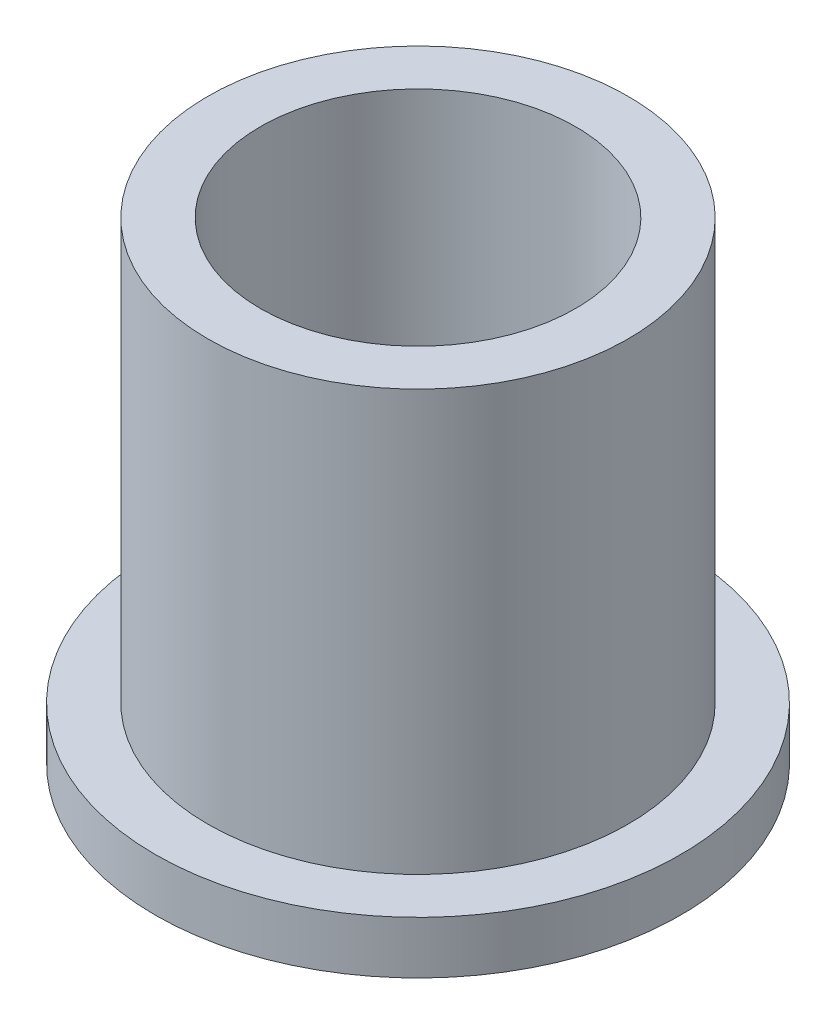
ISO-10303-21;
HEADER;
FILE_DESCRIPTION(('STEP AP214'),'2;1');
FILE_NAME('part.step','',(''),(''),'','','');
FILE_SCHEMA(('AUTOMOTIVE_DESIGN { 1 0 10303 214 1 1 1 1 }'));
ENDSEC;
DATA;
#1=APPLICATION_CONTEXT('core data for automotive mechanical design processes');
#2=APPLICATION_PROTOCOL_DEFINITION('international standard','automotive_design',2000,#1);
#3=PRODUCT_CONTEXT('',#1,'mechanical');
#4=PRODUCT('Part','Part','',(#3));
#5=PRODUCT_RELATED_PRODUCT_CATEGORY('part','',(#4));
#6=PRODUCT_DEFINITION_FORMATION('','',#4);
#7=PRODUCT_DEFINITION_CONTEXT('part definition',#1,'design');
#8=PRODUCT_DEFINITION('design','',#6,#7);
#9=PRODUCT_DEFINITION_SHAPE('','',#8);
#10=(LENGTH_UNIT() NAMED_UNIT(*) SI_UNIT(.MILLI.,.METRE.));
#11=(NAMED_UNIT(*) PLANE_ANGLE_UNIT() SI_UNIT($,.RADIAN.));
#12=(NAMED_UNIT(*) SI_UNIT($,.STERADIAN.) SOLID_ANGLE_UNIT());
#13=UNCERTAINTY_MEASURE_WITH_UNIT(LENGTH_MEASURE(1.E-05),#10,'distance_accuracy_value','');
#14=(GEOMETRIC_REPRESENTATION_CONTEXT(3) GLOBAL_UNCERTAINTY_ASSIGNED_CONTEXT((#13)) GLOBAL_UNIT_ASSIGNED_CONTEXT((#10,
#11,#12)) REPRESENTATION_CONTEXT('',''));
#15=CARTESIAN_POINT('',(0.,0.,0.));
#16=DIRECTION('',(0.,0.,1.));
#17=DIRECTION('',(1.,0.,0.));
#18=AXIS2_PLACEMENT_3D('',#15,#16,#17);
#19=CARTESIAN_POINT('',(0.,-1.5875,0.));
#20=DIRECTION('',(0.,-1.,0.));
#21=DIRECTION('',(0.,0.,-1.));
#22=AXIS2_PLACEMENT_3D('',#19,#20,#21);
#23=PLANE('',#22);
#24=CARTESIAN_POINT('',(0.,-1.5875,0.));
#25=DIRECTION('',(0.,-1.,0.));
#26=DIRECTION('',(0.,0.,-1.));
#27=AXIS2_PLACEMENT_3D('',#24,#25,#26);
#28=CIRCLE('',#27,7.9375);
#29=CARTESIAN_POINT('',(0.,-1.5875,-7.9375));
#30=VERTEX_POINT('',#29);
#31=EDGE_CURVE('E11',#30,#30,#28,.T.);
#32=ORIENTED_EDGE('',*,*,#31,.T.);
#33=EDGE_LOOP('',(#32));
#34=FACE_BOUND('',#33,.T.);
#35=CARTESIAN_POINT('',(0.,-1.5875,0.));
#36=DIRECTION('',(0.,-1.,0.));
#37=DIRECTION('',(0.,0.,-1.));
#38=AXIS2_PLACEMENT_3D('',#35,#36,#37);
#39=CIRCLE('',#38,4.7625);
#40=CARTESIAN_POINT('',(0.,-1.5875,-4.7625));
#41=VERTEX_POINT('',#40);
#42=EDGE_CURVE('E54',#41,#41,#39,.T.);
#43=ORIENTED_EDGE('',*,*,#42,.F.);
#44=EDGE_LOOP('',(#43));
#45=FACE_BOUND('',#44,.T.);
#46=ADVANCED_FACE('F43',(#34,#45),#23,.T.);
#47=CARTESIAN_POINT('',(0.,0.,0.));
#48=DIRECTION('',(0.,-1.,0.));
#49=DIRECTION('',(0.,0.,-1.));
#50=AXIS2_PLACEMENT_3D('',#47,#48,#49);
#51=PLANE('',#50);
#52=CARTESIAN_POINT('',(0.,0.,0.));
#53=DIRECTION('',(0.,-1.,0.));
#54=DIRECTION('',(0.,0.,-1.));
#55=AXIS2_PLACEMENT_3D('',#52,#53,#54);
#56=CIRCLE('',#55,7.9375);
#57=CARTESIAN_POINT('',(0.,0.,-7.9375));
#58=VERTEX_POINT('',#57);
#59=EDGE_CURVE('E47',#58,#58,#56,.T.);
#60=ORIENTED_EDGE('',*,*,#59,.F.);
#61=EDGE_LOOP('',(#60));
#62=FACE_BOUND('',#61,.T.);
#63=CARTESIAN_POINT('',(0.,0.,0.));
#64=DIRECTION('',(0.,-1.,0.));
#65=DIRECTION('',(0.,0.,-1.));
#66=AXIS2_PLACEMENT_3D('',#63,#64,#65);
#67=CIRCLE('',#66,4.7625);
#68=CARTESIAN_POINT('',(0.,0.,-4.7625));
#69=VERTEX_POINT('',#68);
#70=EDGE_CURVE('E56',#69,#69,#67,.T.);
#71=ORIENTED_EDGE('',*,*,#70,.T.);
#72=EDGE_LOOP('',(#71));
#73=FACE_BOUND('',#72,.T.);
#74=ADVANCED_FACE('F66',(#62,#73),#51,.F.);
#75=CARTESIAN_POINT('',(0.,-1.5875,0.));
#76=DIRECTION('',(0.,1.,0.));
#77=DIRECTION('',(0.,0.,1.));
#78=AXIS2_PLACEMENT_3D('',#75,#76,#77);
#79=CYLINDRICAL_SURFACE('',#78,7.9375);
#80=ORIENTED_EDGE('',*,*,#31,.F.);
#81=EDGE_LOOP('',(#80));
#82=FACE_BOUND('',#81,.T.);
#83=ORIENTED_EDGE('',*,*,#59,.T.);
#84=EDGE_LOOP('',(#83));
#85=FACE_BOUND('',#84,.T.);
#86=ADVANCED_FACE('F45',(#82,#85),#79,.T.);
#87=CARTESIAN_POINT('',(0.,-1.5875,0.));
#88=DIRECTION('',(0.,1.,0.));
#89=DIRECTION('',(0.,0.,1.));
#90=AXIS2_PLACEMENT_3D('',#87,#88,#89);
#91=CYLINDRICAL_SURFACE('',#90,4.7625);
#92=ORIENTED_EDGE('',*,*,#42,.T.);
#93=EDGE_LOOP('',(#92));
#94=FACE_BOUND('',#93,.T.);
#95=ORIENTED_EDGE('',*,*,#70,.F.);
#96=EDGE_LOOP('',(#95));
#97=FACE_BOUND('',#96,.T.);
#98=ADVANCED_FACE('F62',(#94,#97),#91,.F.);
#99=CLOSED_SHELL('',(#46,#74,#86,#98));
#100=MANIFOLD_SOLID_BREP('B2',#99);
#101=CARTESIAN_POINT('',(0.,12.7,0.));
#102=DIRECTION('',(0.,1.,0.));
#103=DIRECTION('',(0.,0.,1.));
#104=AXIS2_PLACEMENT_3D('',#101,#102,#103);
#105=PLANE('',#104);
#106=CARTESIAN_POINT('',(0.,12.7,0.));
#107=DIRECTION('',(0.,1.,0.));
#108=DIRECTION('',(0.,0.,1.));
#109=AXIS2_PLACEMENT_3D('',#106,#107,#108);
#110=CIRCLE('',#109,6.35);
#111=CARTESIAN_POINT('',(0.,12.7,6.35));
#112=VERTEX_POINT('',#111);
#113=EDGE_CURVE('E42',#112,#112,#110,.T.);
#114=ORIENTED_EDGE('',*,*,#113,.T.);
#115=EDGE_LOOP('',(#114));
#116=FACE_BOUND('',#115,.T.);
#117=CARTESIAN_POINT('',(0.,12.7,0.));
#118=DIRECTION('',(0.,1.,0.));
#119=DIRECTION('',(0.,0.,1.));
#120=AXIS2_PLACEMENT_3D('',#117,#118,#119);
#121=CIRCLE('',#120,4.7625);
#122=CARTESIAN_POINT('',(0.,12.7,4.7625));
#123=VERTEX_POINT('',#122);
#124=EDGE_CURVE('E116',#123,#123,#121,.T.);
#125=ORIENTED_EDGE('',*,*,#124,.F.);
#126=EDGE_LOOP('',(#125));
#127=FACE_BOUND('',#126,.T.);
#128=ADVANCED_FACE('F105',(#116,#127),#105,.T.);
#129=CARTESIAN_POINT('',(0.,0.,0.));
#130=DIRECTION('',(0.,1.,0.));
#131=DIRECTION('',(0.,0.,1.));
#132=AXIS2_PLACEMENT_3D('',#129,#130,#131);
#133=PLANE('',#132);
#134=CARTESIAN_POINT('',(0.,0.,0.));
#135=DIRECTION('',(0.,1.,0.));
#136=DIRECTION('',(0.,0.,1.));
#137=AXIS2_PLACEMENT_3D('',#134,#135,#136);
#138=CIRCLE('',#137,6.35);
#139=CARTESIAN_POINT('',(0.,0.,6.35));
#140=VERTEX_POINT('',#139);
#141=EDGE_CURVE('E109',#140,#140,#138,.T.);
#142=ORIENTED_EDGE('',*,*,#141,.F.);
#143=EDGE_LOOP('',(#142));
#144=FACE_BOUND('',#143,.T.);
#145=CARTESIAN_POINT('',(0.,0.,0.));
#146=DIRECTION('',(0.,1.,0.));
#147=DIRECTION('',(0.,0.,1.));
#148=AXIS2_PLACEMENT_3D('',#145,#146,#147);
#149=CIRCLE('',#148,4.7625);
#150=CARTESIAN_POINT('',(0.,0.,4.7625));
#151=VERTEX_POINT('',#150);
#152=EDGE_CURVE('E118',#151,#151,#149,.T.);
#153=ORIENTED_EDGE('',*,*,#152,.T.);
#154=EDGE_LOOP('',(#153));
#155=FACE_BOUND('',#154,.T.);
#156=ADVANCED_FACE('F128',(#144,#155),#133,.F.);
#157=CARTESIAN_POINT('',(0.,12.7,0.));
#158=DIRECTION('',(0.,-1.,0.));
#159=DIRECTION('',(0.,0.,-1.));
#160=AXIS2_PLACEMENT_3D('',#157,#158,#159);
#161=CYLINDRICAL_SURFACE('',#160,6.35);
#162=ORIENTED_EDGE('',*,*,#113,.F.);
#163=EDGE_LOOP('',(#162));
#164=FACE_BOUND('',#163,.T.);
#165=ORIENTED_EDGE('',*,*,#141,.T.);
#166=EDGE_LOOP('',(#165));
#167=FACE_BOUND('',#166,.T.);
#168=ADVANCED_FACE('F107',(#164,#167),#161,.T.);
#169=CARTESIAN_POINT('',(0.,12.7,0.));
#170=DIRECTION('',(0.,-1.,0.));
#171=DIRECTION('',(0.,0.,-1.));
#172=AXIS2_PLACEMENT_3D('',#169,#170,#171);
#173=CYLINDRICAL_SURFACE('',#172,4.7625);
#174=ORIENTED_EDGE('',*,*,#124,.T.);
#175=EDGE_LOOP('',(#174));
#176=FACE_BOUND('',#175,.T.);
#177=ORIENTED_EDGE('',*,*,#152,.F.);
#178=EDGE_LOOP('',(#177));
#179=FACE_BOUND('',#178,.T.);
#180=ADVANCED_FACE('F124',(#176,#179),#173,.F.);
#181=CLOSED_SHELL('',(#128,#156,#168,#180));
#182=MANIFOLD_SOLID_BREP('B6',#181);
#183=ADVANCED_BREP_SHAPE_REPRESENTATION('',(#18,#100,#182),#14);
#184=SHAPE_DEFINITION_REPRESENTATION(#9,#183);
ENDSEC;
END-ISO-10303-21;
